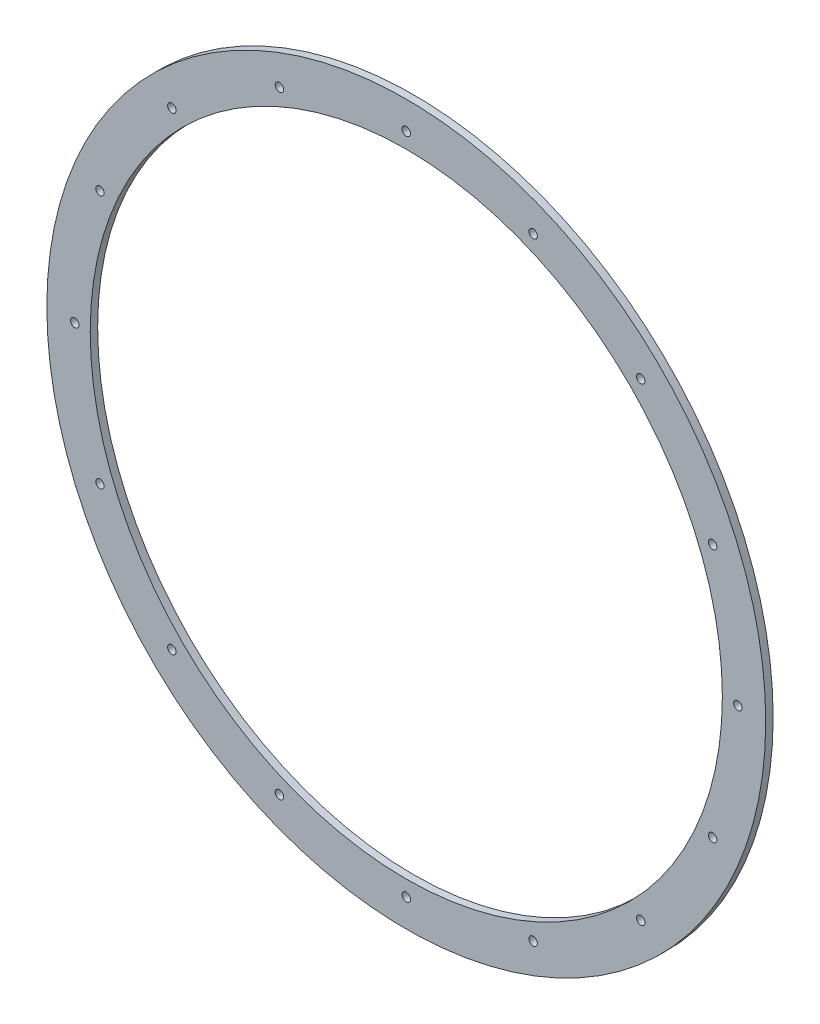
ISO-10303-21;
HEADER;
FILE_DESCRIPTION(('STEP AP214'),'2;1');
FILE_NAME('part.step','',(''),(''),'','','');
FILE_SCHEMA(('AUTOMOTIVE_DESIGN { 1 0 10303 214 1 1 1 1 }'));
ENDSEC;
DATA;
#1=APPLICATION_CONTEXT('core data for automotive mechanical design processes');
#2=APPLICATION_PROTOCOL_DEFINITION('international standard','automotive_design',2000,#1);
#3=PRODUCT_CONTEXT('',#1,'mechanical');
#4=PRODUCT('Part','Part','',(#3));
#5=PRODUCT_RELATED_PRODUCT_CATEGORY('part','',(#4));
#6=PRODUCT_DEFINITION_FORMATION('','',#4);
#7=PRODUCT_DEFINITION_CONTEXT('part definition',#1,'design');
#8=PRODUCT_DEFINITION('design','',#6,#7);
#9=PRODUCT_DEFINITION_SHAPE('','',#8);
#10=(LENGTH_UNIT() NAMED_UNIT(*) SI_UNIT(.MILLI.,.METRE.));
#11=(NAMED_UNIT(*) PLANE_ANGLE_UNIT() SI_UNIT($,.RADIAN.));
#12=(NAMED_UNIT(*) SI_UNIT($,.STERADIAN.) SOLID_ANGLE_UNIT());
#13=UNCERTAINTY_MEASURE_WITH_UNIT(LENGTH_MEASURE(1.E-05),#10,'distance_accuracy_value','');
#14=(GEOMETRIC_REPRESENTATION_CONTEXT(3) GLOBAL_UNCERTAINTY_ASSIGNED_CONTEXT((#13)) GLOBAL_UNIT_ASSIGNED_CONTEXT((#10,
#11,#12)) REPRESENTATION_CONTEXT('',''));
#15=CARTESIAN_POINT('',(0.,0.,0.));
#16=DIRECTION('',(0.,0.,1.));
#17=DIRECTION('',(1.,0.,0.));
#18=AXIS2_PLACEMENT_3D('',#15,#16,#17);
#19=CARTESIAN_POINT('',(0.,0.,3.));
#20=DIRECTION('',(0.,0.,1.));
#21=DIRECTION('',(1.,0.,0.));
#22=AXIS2_PLACEMENT_3D('',#19,#20,#21);
#23=PLANE('',#22);
#24=CARTESIAN_POINT('',(-102.36781815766,-247.13777494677,3.));
#25=DIRECTION('',(0.,0.,-1.));
#26=DIRECTION('',(-1.,0.,0.));
#27=AXIS2_PLACEMENT_3D('',#24,#25,#26);
#28=CIRCLE('',#27,3.4);
#29=CARTESIAN_POINT('',(-105.76781815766,-247.13777494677,3.));
#30=VERTEX_POINT('',#29);
#31=EDGE_CURVE('E89',#30,#30,#28,.T.);
#32=ORIENTED_EDGE('',*,*,#31,.T.);
#33=EDGE_LOOP('',(#32));
#34=FACE_BOUND('',#33,.T.);
#35=CARTESIAN_POINT('',(-189.1510639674,-189.151063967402,3.));
#36=DIRECTION('',(0.,0.,-1.));
#37=DIRECTION('',(-1.,0.,0.));
#38=AXIS2_PLACEMENT_3D('',#35,#36,#37);
#39=CIRCLE('',#38,3.39999999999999);
#40=CARTESIAN_POINT('',(-192.5510639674,-189.151063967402,3.));
#41=VERTEX_POINT('',#40);
#42=EDGE_CURVE('E83',#41,#41,#39,.T.);
#43=ORIENTED_EDGE('',*,*,#42,.T.);
#44=EDGE_LOOP('',(#43));
#45=FACE_BOUND('',#44,.T.);
#46=CARTESIAN_POINT('',(-247.137774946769,-102.367818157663,3.));
#47=DIRECTION('',(0.,0.,-1.));
#48=DIRECTION('',(-1.,0.,0.));
#49=AXIS2_PLACEMENT_3D('',#46,#47,#48);
#50=CIRCLE('',#49,3.39999999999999);
#51=CARTESIAN_POINT('',(-250.537774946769,-102.367818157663,3.));
#52=VERTEX_POINT('',#51);
#53=EDGE_CURVE('E77',#52,#52,#50,.T.);
#54=ORIENTED_EDGE('',*,*,#53,.T.);
#55=EDGE_LOOP('',(#54));
#56=FACE_BOUND('',#55,.T.);
#57=CARTESIAN_POINT('',(-267.5,-9.3397179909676E-13,3.));
#58=DIRECTION('',(0.,0.,-1.));
#59=DIRECTION('',(-1.,0.,0.));
#60=AXIS2_PLACEMENT_3D('',#57,#58,#59);
#61=CIRCLE('',#60,3.40000000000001);
#62=CARTESIAN_POINT('',(-270.9,-9.3397179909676E-13,3.));
#63=VERTEX_POINT('',#62);
#64=EDGE_CURVE('E71',#63,#63,#61,.T.);
#65=ORIENTED_EDGE('',*,*,#64,.T.);
#66=EDGE_LOOP('',(#65));
#67=FACE_BOUND('',#66,.T.);
#68=CARTESIAN_POINT('',(-247.137774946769,102.367818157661,3.));
#69=DIRECTION('',(0.,0.,-1.));
#70=DIRECTION('',(-1.,0.,0.));
#71=AXIS2_PLACEMENT_3D('',#68,#69,#70);
#72=CIRCLE('',#71,3.39999999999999);
#73=CARTESIAN_POINT('',(-250.537774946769,102.367818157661,3.));
#74=VERTEX_POINT('',#73);
#75=EDGE_CURVE('E65',#74,#74,#72,.T.);
#76=ORIENTED_EDGE('',*,*,#75,.T.);
#77=EDGE_LOOP('',(#76));
#78=FACE_BOUND('',#77,.T.);
#79=CARTESIAN_POINT('',(-189.151063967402,189.151063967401,3.));
#80=DIRECTION('',(0.,0.,-1.));
#81=DIRECTION('',(-1.,0.,0.));
#82=AXIS2_PLACEMENT_3D('',#79,#80,#81);
#83=CIRCLE('',#82,3.39999999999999);
#84=CARTESIAN_POINT('',(-192.551063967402,189.151063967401,3.));
#85=VERTEX_POINT('',#84);
#86=EDGE_CURVE('E59',#85,#85,#83,.T.);
#87=ORIENTED_EDGE('',*,*,#86,.T.);
#88=EDGE_LOOP('',(#87));
#89=FACE_BOUND('',#88,.T.);
#90=CARTESIAN_POINT('',(-102.367818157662,247.137774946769,3.));
#91=DIRECTION('',(0.,0.,-1.));
#92=DIRECTION('',(-1.,0.,0.));
#93=AXIS2_PLACEMENT_3D('',#90,#91,#92);
#94=CIRCLE('',#93,3.4);
#95=CARTESIAN_POINT('',(-105.767818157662,247.137774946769,3.));
#96=VERTEX_POINT('',#95);
#97=EDGE_CURVE('E53',#96,#96,#94,.T.);
#98=ORIENTED_EDGE('',*,*,#97,.T.);
#99=EDGE_LOOP('',(#98));
#100=FACE_BOUND('',#99,.T.);
#101=CARTESIAN_POINT('',(0.,267.5,3.));
#102=DIRECTION('',(0.,0.,-1.));
#103=DIRECTION('',(-1.,0.,0.));
#104=AXIS2_PLACEMENT_3D('',#101,#102,#103);
#105=CIRCLE('',#104,3.4);
#106=CARTESIAN_POINT('',(-3.4,267.5,3.));
#107=VERTEX_POINT('',#106);
#108=EDGE_CURVE('E45',#107,#107,#105,.T.);
#109=ORIENTED_EDGE('',*,*,#108,.T.);
#110=EDGE_LOOP('',(#109));
#111=FACE_BOUND('',#110,.T.);
#112=CARTESIAN_POINT('',(0.,0.,3.));
#113=DIRECTION('',(0.,0.,1.));
#114=DIRECTION('',(1.,0.,0.));
#115=AXIS2_PLACEMENT_3D('',#112,#113,#114);
#116=CIRCLE('',#115,290.);
#117=CARTESIAN_POINT('',(290.,0.,3.));
#118=VERTEX_POINT('',#117);
#119=EDGE_CURVE('E10',#118,#118,#116,.T.);
#120=ORIENTED_EDGE('',*,*,#119,.T.);
#121=EDGE_LOOP('',(#120));
#122=FACE_BOUND('',#121,.T.);
#123=CARTESIAN_POINT('',(0.,0.,3.));
#124=DIRECTION('',(0.,0.,1.));
#125=DIRECTION('',(1.,0.,0.));
#126=AXIS2_PLACEMENT_3D('',#123,#124,#125);
#127=CIRCLE('',#126,255.);
#128=CARTESIAN_POINT('',(255.,0.,3.));
#129=VERTEX_POINT('',#128);
#130=EDGE_CURVE('E40',#129,#129,#127,.T.);
#131=ORIENTED_EDGE('',*,*,#130,.F.);
#132=EDGE_LOOP('',(#131));
#133=FACE_BOUND('',#132,.T.);
#134=CARTESIAN_POINT('',(1.86794359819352E-12,-267.5,3.));
#135=DIRECTION('',(0.,0.,-1.));
#136=DIRECTION('',(-1.,0.,0.));
#137=AXIS2_PLACEMENT_3D('',#134,#135,#136);
#138=CIRCLE('',#137,3.4);
#139=CARTESIAN_POINT('',(-3.39999999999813,-267.5,3.));
#140=VERTEX_POINT('',#139);
#141=EDGE_CURVE('E95',#140,#140,#138,.T.);
#142=ORIENTED_EDGE('',*,*,#141,.T.);
#143=EDGE_LOOP('',(#142));
#144=FACE_BOUND('',#143,.T.);
#145=CARTESIAN_POINT('',(102.367818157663,-247.137774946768,3.));
#146=DIRECTION('',(0.,0.,-1.));
#147=DIRECTION('',(-1.,0.,0.));
#148=AXIS2_PLACEMENT_3D('',#145,#146,#147);
#149=CIRCLE('',#148,3.4);
#150=CARTESIAN_POINT('',(98.9678181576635,-247.137774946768,3.));
#151=VERTEX_POINT('',#150);
#152=EDGE_CURVE('E101',#151,#151,#149,.T.);
#153=ORIENTED_EDGE('',*,*,#152,.T.);
#154=EDGE_LOOP('',(#153));
#155=FACE_BOUND('',#154,.T.);
#156=CARTESIAN_POINT('',(189.151063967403,-189.1510639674,3.));
#157=DIRECTION('',(0.,0.,-1.));
#158=DIRECTION('',(-1.,0.,0.));
#159=AXIS2_PLACEMENT_3D('',#156,#157,#158);
#160=CIRCLE('',#159,3.39999999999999);
#161=CARTESIAN_POINT('',(185.751063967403,-189.1510639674,3.));
#162=VERTEX_POINT('',#161);
#163=EDGE_CURVE('E107',#162,#162,#160,.T.);
#164=ORIENTED_EDGE('',*,*,#163,.T.);
#165=EDGE_LOOP('',(#164));
#166=FACE_BOUND('',#165,.T.);
#167=CARTESIAN_POINT('',(247.13777494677,-102.367818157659,3.));
#168=DIRECTION('',(0.,0.,-1.));
#169=DIRECTION('',(-1.,0.,0.));
#170=AXIS2_PLACEMENT_3D('',#167,#168,#169);
#171=CIRCLE('',#170,3.40000000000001);
#172=CARTESIAN_POINT('',(243.73777494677,-102.367818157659,3.));
#173=VERTEX_POINT('',#172);
#174=EDGE_CURVE('E113',#173,#173,#171,.T.);
#175=ORIENTED_EDGE('',*,*,#174,.T.);
#176=EDGE_LOOP('',(#175));
#177=FACE_BOUND('',#176,.T.);
#178=CARTESIAN_POINT('',(267.5,2.80191539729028E-12,3.));
#179=DIRECTION('',(0.,0.,-1.));
#180=DIRECTION('',(-1.,0.,0.));
#181=AXIS2_PLACEMENT_3D('',#178,#179,#180);
#182=CIRCLE('',#181,3.40000000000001);
#183=CARTESIAN_POINT('',(264.1,2.80191539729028E-12,3.));
#184=VERTEX_POINT('',#183);
#185=EDGE_CURVE('E119',#184,#184,#182,.T.);
#186=ORIENTED_EDGE('',*,*,#185,.T.);
#187=EDGE_LOOP('',(#186));
#188=FACE_BOUND('',#187,.T.);
#189=CARTESIAN_POINT('',(247.137774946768,102.367818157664,3.));
#190=DIRECTION('',(0.,0.,-1.));
#191=DIRECTION('',(-1.,0.,0.));
#192=AXIS2_PLACEMENT_3D('',#189,#190,#191);
#193=CIRCLE('',#192,3.39999999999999);
#194=CARTESIAN_POINT('',(243.737774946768,102.367818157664,3.));
#195=VERTEX_POINT('',#194);
#196=EDGE_CURVE('E125',#195,#195,#193,.T.);
#197=ORIENTED_EDGE('',*,*,#196,.T.);
#198=EDGE_LOOP('',(#197));
#199=FACE_BOUND('',#198,.T.);
#200=CARTESIAN_POINT('',(189.151063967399,189.151063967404,3.));
#201=DIRECTION('',(0.,0.,-1.));
#202=DIRECTION('',(-1.,0.,0.));
#203=AXIS2_PLACEMENT_3D('',#200,#201,#202);
#204=CIRCLE('',#203,3.39999999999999);
#205=CARTESIAN_POINT('',(185.751063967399,189.151063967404,3.));
#206=VERTEX_POINT('',#205);
#207=EDGE_CURVE('E131',#206,#206,#204,.T.);
#208=ORIENTED_EDGE('',*,*,#207,.T.);
#209=EDGE_LOOP('',(#208));
#210=FACE_BOUND('',#209,.T.);
#211=CARTESIAN_POINT('',(102.367818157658,247.137774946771,3.));
#212=DIRECTION('',(0.,0.,-1.));
#213=DIRECTION('',(-1.,0.,0.));
#214=AXIS2_PLACEMENT_3D('',#211,#212,#213);
#215=CIRCLE('',#214,3.4);
#216=CARTESIAN_POINT('',(98.9678181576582,247.137774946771,3.));
#217=VERTEX_POINT('',#216);
#218=EDGE_CURVE('E137',#217,#217,#215,.T.);
#219=ORIENTED_EDGE('',*,*,#218,.T.);
#220=EDGE_LOOP('',(#219));
#221=FACE_BOUND('',#220,.T.);
#222=ADVANCED_FACE('F29',(#34,#45,#56,#67,#78,#89,#100,#111,#122,#133,#144,#155,#166,#177,#188,
#199,#210,#221),#23,.T.);
#223=CARTESIAN_POINT('',(0.,0.,-3.));
#224=DIRECTION('',(0.,0.,1.));
#225=DIRECTION('',(1.,0.,0.));
#226=AXIS2_PLACEMENT_3D('',#223,#224,#225);
#227=PLANE('',#226);
#228=CARTESIAN_POINT('',(102.367818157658,247.137774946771,-3.));
#229=DIRECTION('',(0.,0.,-1.));
#230=DIRECTION('',(-1.,0.,0.));
#231=AXIS2_PLACEMENT_3D('',#228,#229,#230);
#232=CIRCLE('',#231,3.39999999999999);
#233=CARTESIAN_POINT('',(98.9678181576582,247.137774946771,-3.));
#234=VERTEX_POINT('',#233);
#235=EDGE_CURVE('E140',#234,#234,#232,.T.);
#236=ORIENTED_EDGE('',*,*,#235,.F.);
#237=EDGE_LOOP('',(#236));
#238=FACE_BOUND('',#237,.T.);
#239=CARTESIAN_POINT('',(189.151063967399,189.151063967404,-3.));
#240=DIRECTION('',(0.,0.,-1.));
#241=DIRECTION('',(-1.,0.,0.));
#242=AXIS2_PLACEMENT_3D('',#239,#240,#241);
#243=CIRCLE('',#242,3.39999999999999);
#244=CARTESIAN_POINT('',(185.751063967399,189.151063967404,-3.));
#245=VERTEX_POINT('',#244);
#246=EDGE_CURVE('E134',#245,#245,#243,.T.);
#247=ORIENTED_EDGE('',*,*,#246,.F.);
#248=EDGE_LOOP('',(#247));
#249=FACE_BOUND('',#248,.T.);
#250=CARTESIAN_POINT('',(247.137774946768,102.367818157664,-3.));
#251=DIRECTION('',(0.,0.,-1.));
#252=DIRECTION('',(-1.,0.,0.));
#253=AXIS2_PLACEMENT_3D('',#250,#251,#252);
#254=CIRCLE('',#253,3.39999999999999);
#255=CARTESIAN_POINT('',(243.737774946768,102.367818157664,-3.));
#256=VERTEX_POINT('',#255);
#257=EDGE_CURVE('E128',#256,#256,#254,.T.);
#258=ORIENTED_EDGE('',*,*,#257,.F.);
#259=EDGE_LOOP('',(#258));
#260=FACE_BOUND('',#259,.T.);
#261=CARTESIAN_POINT('',(267.5,2.80191539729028E-12,-3.));
#262=DIRECTION('',(0.,0.,-1.));
#263=DIRECTION('',(-1.,0.,0.));
#264=AXIS2_PLACEMENT_3D('',#261,#262,#263);
#265=CIRCLE('',#264,3.40000000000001);
#266=CARTESIAN_POINT('',(264.1,2.80191539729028E-12,-3.));
#267=VERTEX_POINT('',#266);
#268=EDGE_CURVE('E122',#267,#267,#265,.T.);
#269=ORIENTED_EDGE('',*,*,#268,.F.);
#270=EDGE_LOOP('',(#269));
#271=FACE_BOUND('',#270,.T.);
#272=CARTESIAN_POINT('',(247.13777494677,-102.367818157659,-3.));
#273=DIRECTION('',(0.,0.,-1.));
#274=DIRECTION('',(-1.,0.,0.));
#275=AXIS2_PLACEMENT_3D('',#272,#273,#274);
#276=CIRCLE('',#275,3.40000000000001);
#277=CARTESIAN_POINT('',(243.73777494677,-102.367818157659,-3.));
#278=VERTEX_POINT('',#277);
#279=EDGE_CURVE('E116',#278,#278,#276,.T.);
#280=ORIENTED_EDGE('',*,*,#279,.F.);
#281=EDGE_LOOP('',(#280));
#282=FACE_BOUND('',#281,.T.);
#283=CARTESIAN_POINT('',(189.151063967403,-189.1510639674,-3.));
#284=DIRECTION('',(0.,0.,-1.));
#285=DIRECTION('',(-1.,0.,0.));
#286=AXIS2_PLACEMENT_3D('',#283,#284,#285);
#287=CIRCLE('',#286,3.39999999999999);
#288=CARTESIAN_POINT('',(185.751063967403,-189.1510639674,-3.));
#289=VERTEX_POINT('',#288);
#290=EDGE_CURVE('E110',#289,#289,#287,.T.);
#291=ORIENTED_EDGE('',*,*,#290,.F.);
#292=EDGE_LOOP('',(#291));
#293=FACE_BOUND('',#292,.T.);
#294=CARTESIAN_POINT('',(102.367818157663,-247.137774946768,-3.));
#295=DIRECTION('',(0.,0.,-1.));
#296=DIRECTION('',(-1.,0.,0.));
#297=AXIS2_PLACEMENT_3D('',#294,#295,#296);
#298=CIRCLE('',#297,3.39999999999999);
#299=CARTESIAN_POINT('',(98.9678181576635,-247.137774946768,-3.));
#300=VERTEX_POINT('',#299);
#301=EDGE_CURVE('E104',#300,#300,#298,.T.);
#302=ORIENTED_EDGE('',*,*,#301,.F.);
#303=EDGE_LOOP('',(#302));
#304=FACE_BOUND('',#303,.T.);
#305=CARTESIAN_POINT('',(0.,267.5,-3.));
#306=DIRECTION('',(0.,0.,-1.));
#307=DIRECTION('',(-1.,0.,0.));
#308=AXIS2_PLACEMENT_3D('',#305,#306,#307);
#309=CIRCLE('',#308,3.39999999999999);
#310=CARTESIAN_POINT('',(-3.39999999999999,267.5,-3.));
#311=VERTEX_POINT('',#310);
#312=EDGE_CURVE('E50',#311,#311,#309,.T.);
#313=ORIENTED_EDGE('',*,*,#312,.F.);
#314=EDGE_LOOP('',(#313));
#315=FACE_BOUND('',#314,.T.);
#316=CARTESIAN_POINT('',(0.,0.,-3.));
#317=DIRECTION('',(0.,0.,1.));
#318=DIRECTION('',(1.,0.,0.));
#319=AXIS2_PLACEMENT_3D('',#316,#317,#318);
#320=CIRCLE('',#319,290.);
#321=CARTESIAN_POINT('',(290.,0.,-3.));
#322=VERTEX_POINT('',#321);
#323=EDGE_CURVE('E33',#322,#322,#320,.T.);
#324=ORIENTED_EDGE('',*,*,#323,.F.);
#325=EDGE_LOOP('',(#324));
#326=FACE_BOUND('',#325,.T.);
#327=CARTESIAN_POINT('',(0.,0.,-3.));
#328=DIRECTION('',(0.,0.,1.));
#329=DIRECTION('',(1.,0.,0.));
#330=AXIS2_PLACEMENT_3D('',#327,#328,#329);
#331=CIRCLE('',#330,255.);
#332=CARTESIAN_POINT('',(255.,0.,-3.));
#333=VERTEX_POINT('',#332);
#334=EDGE_CURVE('E42',#333,#333,#331,.T.);
#335=ORIENTED_EDGE('',*,*,#334,.T.);
#336=EDGE_LOOP('',(#335));
#337=FACE_BOUND('',#336,.T.);
#338=CARTESIAN_POINT('',(-102.367818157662,247.137774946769,-3.));
#339=DIRECTION('',(0.,0.,-1.));
#340=DIRECTION('',(-1.,0.,0.));
#341=AXIS2_PLACEMENT_3D('',#338,#339,#340);
#342=CIRCLE('',#341,3.39999999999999);
#343=CARTESIAN_POINT('',(-105.767818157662,247.137774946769,-3.));
#344=VERTEX_POINT('',#343);
#345=EDGE_CURVE('E56',#344,#344,#342,.T.);
#346=ORIENTED_EDGE('',*,*,#345,.F.);
#347=EDGE_LOOP('',(#346));
#348=FACE_BOUND('',#347,.T.);
#349=CARTESIAN_POINT('',(-189.151063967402,189.151063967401,-3.));
#350=DIRECTION('',(0.,0.,-1.));
#351=DIRECTION('',(-1.,0.,0.));
#352=AXIS2_PLACEMENT_3D('',#349,#350,#351);
#353=CIRCLE('',#352,3.39999999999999);
#354=CARTESIAN_POINT('',(-192.551063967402,189.151063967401,-3.));
#355=VERTEX_POINT('',#354);
#356=EDGE_CURVE('E62',#355,#355,#353,.T.);
#357=ORIENTED_EDGE('',*,*,#356,.F.);
#358=EDGE_LOOP('',(#357));
#359=FACE_BOUND('',#358,.T.);
#360=CARTESIAN_POINT('',(-247.137774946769,102.367818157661,-3.));
#361=DIRECTION('',(0.,0.,-1.));
#362=DIRECTION('',(-1.,0.,0.));
#363=AXIS2_PLACEMENT_3D('',#360,#361,#362);
#364=CIRCLE('',#363,3.39999999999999);
#365=CARTESIAN_POINT('',(-250.537774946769,102.367818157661,-3.));
#366=VERTEX_POINT('',#365);
#367=EDGE_CURVE('E68',#366,#366,#364,.T.);
#368=ORIENTED_EDGE('',*,*,#367,.F.);
#369=EDGE_LOOP('',(#368));
#370=FACE_BOUND('',#369,.T.);
#371=CARTESIAN_POINT('',(-267.5,-9.3397179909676E-13,-3.));
#372=DIRECTION('',(0.,0.,-1.));
#373=DIRECTION('',(-1.,0.,0.));
#374=AXIS2_PLACEMENT_3D('',#371,#372,#373);
#375=CIRCLE('',#374,3.40000000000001);
#376=CARTESIAN_POINT('',(-270.9,-9.3397179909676E-13,-3.));
#377=VERTEX_POINT('',#376);
#378=EDGE_CURVE('E74',#377,#377,#375,.T.);
#379=ORIENTED_EDGE('',*,*,#378,.F.);
#380=EDGE_LOOP('',(#379));
#381=FACE_BOUND('',#380,.T.);
#382=CARTESIAN_POINT('',(-247.137774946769,-102.367818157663,-3.));
#383=DIRECTION('',(0.,0.,-1.));
#384=DIRECTION('',(-1.,0.,0.));
#385=AXIS2_PLACEMENT_3D('',#382,#383,#384);
#386=CIRCLE('',#385,3.39999999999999);
#387=CARTESIAN_POINT('',(-250.537774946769,-102.367818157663,-3.));
#388=VERTEX_POINT('',#387);
#389=EDGE_CURVE('E80',#388,#388,#386,.T.);
#390=ORIENTED_EDGE('',*,*,#389,.F.);
#391=EDGE_LOOP('',(#390));
#392=FACE_BOUND('',#391,.T.);
#393=CARTESIAN_POINT('',(-189.1510639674,-189.151063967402,-3.));
#394=DIRECTION('',(0.,0.,-1.));
#395=DIRECTION('',(-1.,0.,0.));
#396=AXIS2_PLACEMENT_3D('',#393,#394,#395);
#397=CIRCLE('',#396,3.39999999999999);
#398=CARTESIAN_POINT('',(-192.5510639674,-189.151063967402,-3.));
#399=VERTEX_POINT('',#398);
#400=EDGE_CURVE('E86',#399,#399,#397,.T.);
#401=ORIENTED_EDGE('',*,*,#400,.F.);
#402=EDGE_LOOP('',(#401));
#403=FACE_BOUND('',#402,.T.);
#404=CARTESIAN_POINT('',(-102.36781815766,-247.13777494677,-3.));
#405=DIRECTION('',(0.,0.,-1.));
#406=DIRECTION('',(-1.,0.,0.));
#407=AXIS2_PLACEMENT_3D('',#404,#405,#406);
#408=CIRCLE('',#407,3.39999999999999);
#409=CARTESIAN_POINT('',(-105.76781815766,-247.13777494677,-3.));
#410=VERTEX_POINT('',#409);
#411=EDGE_CURVE('E92',#410,#410,#408,.T.);
#412=ORIENTED_EDGE('',*,*,#411,.F.);
#413=EDGE_LOOP('',(#412));
#414=FACE_BOUND('',#413,.T.);
#415=CARTESIAN_POINT('',(1.86794359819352E-12,-267.5,-3.));
#416=DIRECTION('',(0.,0.,-1.));
#417=DIRECTION('',(-1.,0.,0.));
#418=AXIS2_PLACEMENT_3D('',#415,#416,#417);
#419=CIRCLE('',#418,3.39999999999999);
#420=CARTESIAN_POINT('',(-3.39999999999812,-267.5,-3.));
#421=VERTEX_POINT('',#420);
#422=EDGE_CURVE('E98',#421,#421,#419,.T.);
#423=ORIENTED_EDGE('',*,*,#422,.F.);
#424=EDGE_LOOP('',(#423));
#425=FACE_BOUND('',#424,.T.);
#426=ADVANCED_FACE('F146',(#238,#249,#260,#271,#282,#293,#304,#315,#326,#337,#348,#359,#370,
#381,#392,#403,#414,#425),#227,.F.);
#427=CARTESIAN_POINT('',(0.,0.,3.));
#428=DIRECTION('',(0.,0.,-1.));
#429=DIRECTION('',(-1.,0.,0.));
#430=AXIS2_PLACEMENT_3D('',#427,#428,#429);
#431=CYLINDRICAL_SURFACE('',#430,290.);
#432=ORIENTED_EDGE('',*,*,#119,.F.);
#433=EDGE_LOOP('',(#432));
#434=FACE_BOUND('',#433,.T.);
#435=ORIENTED_EDGE('',*,*,#323,.T.);
#436=EDGE_LOOP('',(#435));
#437=FACE_BOUND('',#436,.T.);
#438=ADVANCED_FACE('F31',(#434,#437),#431,.T.);
#439=CARTESIAN_POINT('',(0.,0.,3.));
#440=DIRECTION('',(0.,0.,-1.));
#441=DIRECTION('',(-1.,0.,0.));
#442=AXIS2_PLACEMENT_3D('',#439,#440,#441);
#443=CYLINDRICAL_SURFACE('',#442,255.);
#444=ORIENTED_EDGE('',*,*,#130,.T.);
#445=EDGE_LOOP('',(#444));
#446=FACE_BOUND('',#445,.T.);
#447=ORIENTED_EDGE('',*,*,#334,.F.);
#448=EDGE_LOOP('',(#447));
#449=FACE_BOUND('',#448,.T.);
#450=ADVANCED_FACE('F207',(#446,#449),#443,.F.);
#451=CARTESIAN_POINT('',(0.,267.5,-3.));
#452=DIRECTION('',(0.,0.,-1.));
#453=DIRECTION('',(-1.,0.,0.));
#454=AXIS2_PLACEMENT_3D('',#451,#452,#453);
#455=CYLINDRICAL_SURFACE('',#454,3.39999999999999);
#456=ORIENTED_EDGE('',*,*,#108,.F.);
#457=EDGE_LOOP('',(#456));
#458=FACE_BOUND('',#457,.T.);
#459=ORIENTED_EDGE('',*,*,#312,.T.);
#460=EDGE_LOOP('',(#459));
#461=FACE_BOUND('',#460,.T.);
#462=ADVANCED_FACE('F210',(#458,#461),#455,.F.);
#463=CARTESIAN_POINT('',(-102.367818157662,247.137774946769,-3.));
#464=DIRECTION('',(0.,0.,-1.));
#465=DIRECTION('',(-1.,0.,0.));
#466=AXIS2_PLACEMENT_3D('',#463,#464,#465);
#467=CYLINDRICAL_SURFACE('',#466,3.39999999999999);
#468=ORIENTED_EDGE('',*,*,#97,.F.);
#469=EDGE_LOOP('',(#468));
#470=FACE_BOUND('',#469,.T.);
#471=ORIENTED_EDGE('',*,*,#345,.T.);
#472=EDGE_LOOP('',(#471));
#473=FACE_BOUND('',#472,.T.);
#474=ADVANCED_FACE('F214',(#470,#473),#467,.F.);
#475=CARTESIAN_POINT('',(-189.151063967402,189.151063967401,-3.));
#476=DIRECTION('',(0.,0.,-1.));
#477=DIRECTION('',(-1.,0.,0.));
#478=AXIS2_PLACEMENT_3D('',#475,#476,#477);
#479=CYLINDRICAL_SURFACE('',#478,3.39999999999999);
#480=ORIENTED_EDGE('',*,*,#86,.F.);
#481=EDGE_LOOP('',(#480));
#482=FACE_BOUND('',#481,.T.);
#483=ORIENTED_EDGE('',*,*,#356,.T.);
#484=EDGE_LOOP('',(#483));
#485=FACE_BOUND('',#484,.T.);
#486=ADVANCED_FACE('F218',(#482,#485),#479,.F.);
#487=CARTESIAN_POINT('',(-247.137774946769,102.367818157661,-3.));
#488=DIRECTION('',(0.,0.,-1.));
#489=DIRECTION('',(-1.,0.,0.));
#490=AXIS2_PLACEMENT_3D('',#487,#488,#489);
#491=CYLINDRICAL_SURFACE('',#490,3.39999999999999);
#492=ORIENTED_EDGE('',*,*,#75,.F.);
#493=EDGE_LOOP('',(#492));
#494=FACE_BOUND('',#493,.T.);
#495=ORIENTED_EDGE('',*,*,#367,.T.);
#496=EDGE_LOOP('',(#495));
#497=FACE_BOUND('',#496,.T.);
#498=ADVANCED_FACE('F222',(#494,#497),#491,.F.);
#499=CARTESIAN_POINT('',(-267.5,-9.3397179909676E-13,-3.));
#500=DIRECTION('',(0.,0.,-1.));
#501=DIRECTION('',(-1.,0.,0.));
#502=AXIS2_PLACEMENT_3D('',#499,#500,#501);
#503=CYLINDRICAL_SURFACE('',#502,3.40000000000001);
#504=ORIENTED_EDGE('',*,*,#64,.F.);
#505=EDGE_LOOP('',(#504));
#506=FACE_BOUND('',#505,.T.);
#507=ORIENTED_EDGE('',*,*,#378,.T.);
#508=EDGE_LOOP('',(#507));
#509=FACE_BOUND('',#508,.T.);
#510=ADVANCED_FACE('F226',(#506,#509),#503,.F.);
#511=CARTESIAN_POINT('',(-247.137774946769,-102.367818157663,-3.));
#512=DIRECTION('',(0.,0.,-1.));
#513=DIRECTION('',(-1.,0.,0.));
#514=AXIS2_PLACEMENT_3D('',#511,#512,#513);
#515=CYLINDRICAL_SURFACE('',#514,3.39999999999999);
#516=ORIENTED_EDGE('',*,*,#53,.F.);
#517=EDGE_LOOP('',(#516));
#518=FACE_BOUND('',#517,.T.);
#519=ORIENTED_EDGE('',*,*,#389,.T.);
#520=EDGE_LOOP('',(#519));
#521=FACE_BOUND('',#520,.T.);
#522=ADVANCED_FACE('F230',(#518,#521),#515,.F.);
#523=CARTESIAN_POINT('',(-189.1510639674,-189.151063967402,-3.));
#524=DIRECTION('',(0.,0.,-1.));
#525=DIRECTION('',(-1.,0.,0.));
#526=AXIS2_PLACEMENT_3D('',#523,#524,#525);
#527=CYLINDRICAL_SURFACE('',#526,3.39999999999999);
#528=ORIENTED_EDGE('',*,*,#42,.F.);
#529=EDGE_LOOP('',(#528));
#530=FACE_BOUND('',#529,.T.);
#531=ORIENTED_EDGE('',*,*,#400,.T.);
#532=EDGE_LOOP('',(#531));
#533=FACE_BOUND('',#532,.T.);
#534=ADVANCED_FACE('F196',(#530,#533),#527,.F.);
#535=CARTESIAN_POINT('',(-102.36781815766,-247.13777494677,-3.));
#536=DIRECTION('',(0.,0.,-1.));
#537=DIRECTION('',(-1.,0.,0.));
#538=AXIS2_PLACEMENT_3D('',#535,#536,#537);
#539=CYLINDRICAL_SURFACE('',#538,3.39999999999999);
#540=ORIENTED_EDGE('',*,*,#31,.F.);
#541=EDGE_LOOP('',(#540));
#542=FACE_BOUND('',#541,.T.);
#543=ORIENTED_EDGE('',*,*,#411,.T.);
#544=EDGE_LOOP('',(#543));
#545=FACE_BOUND('',#544,.T.);
#546=ADVANCED_FACE('F186',(#542,#545),#539,.F.);
#547=CARTESIAN_POINT('',(1.86794359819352E-12,-267.5,-3.));
#548=DIRECTION('',(0.,0.,-1.));
#549=DIRECTION('',(-1.,0.,0.));
#550=AXIS2_PLACEMENT_3D('',#547,#548,#549);
#551=CYLINDRICAL_SURFACE('',#550,3.39999999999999);
#552=ORIENTED_EDGE('',*,*,#141,.F.);
#553=EDGE_LOOP('',(#552));
#554=FACE_BOUND('',#553,.T.);
#555=ORIENTED_EDGE('',*,*,#422,.T.);
#556=EDGE_LOOP('',(#555));
#557=FACE_BOUND('',#556,.T.);
#558=ADVANCED_FACE('F183',(#554,#557),#551,.F.);
#559=CARTESIAN_POINT('',(102.367818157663,-247.137774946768,-3.));
#560=DIRECTION('',(0.,0.,-1.));
#561=DIRECTION('',(-1.,0.,0.));
#562=AXIS2_PLACEMENT_3D('',#559,#560,#561);
#563=CYLINDRICAL_SURFACE('',#562,3.39999999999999);
#564=ORIENTED_EDGE('',*,*,#152,.F.);
#565=EDGE_LOOP('',(#564));
#566=FACE_BOUND('',#565,.T.);
#567=ORIENTED_EDGE('',*,*,#301,.T.);
#568=EDGE_LOOP('',(#567));
#569=FACE_BOUND('',#568,.T.);
#570=ADVANCED_FACE('F185',(#566,#569),#563,.F.);
#571=CARTESIAN_POINT('',(189.151063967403,-189.1510639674,-3.));
#572=DIRECTION('',(0.,0.,-1.));
#573=DIRECTION('',(-1.,0.,0.));
#574=AXIS2_PLACEMENT_3D('',#571,#572,#573);
#575=CYLINDRICAL_SURFACE('',#574,3.39999999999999);
#576=ORIENTED_EDGE('',*,*,#163,.F.);
#577=EDGE_LOOP('',(#576));
#578=FACE_BOUND('',#577,.T.);
#579=ORIENTED_EDGE('',*,*,#290,.T.);
#580=EDGE_LOOP('',(#579));
#581=FACE_BOUND('',#580,.T.);
#582=ADVANCED_FACE('F193',(#578,#581),#575,.F.);
#583=CARTESIAN_POINT('',(247.13777494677,-102.367818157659,-3.));
#584=DIRECTION('',(0.,0.,-1.));
#585=DIRECTION('',(-1.,0.,0.));
#586=AXIS2_PLACEMENT_3D('',#583,#584,#585);
#587=CYLINDRICAL_SURFACE('',#586,3.40000000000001);
#588=ORIENTED_EDGE('',*,*,#174,.F.);
#589=EDGE_LOOP('',(#588));
#590=FACE_BOUND('',#589,.T.);
#591=ORIENTED_EDGE('',*,*,#279,.T.);
#592=EDGE_LOOP('',(#591));
#593=FACE_BOUND('',#592,.T.);
#594=ADVANCED_FACE('F287',(#590,#593),#587,.F.);
#595=CARTESIAN_POINT('',(267.5,2.80191539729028E-12,-3.));
#596=DIRECTION('',(0.,0.,-1.));
#597=DIRECTION('',(-1.,0.,0.));
#598=AXIS2_PLACEMENT_3D('',#595,#596,#597);
#599=CYLINDRICAL_SURFACE('',#598,3.40000000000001);
#600=ORIENTED_EDGE('',*,*,#185,.F.);
#601=EDGE_LOOP('',(#600));
#602=FACE_BOUND('',#601,.T.);
#603=ORIENTED_EDGE('',*,*,#268,.T.);
#604=EDGE_LOOP('',(#603));
#605=FACE_BOUND('',#604,.T.);
#606=ADVANCED_FACE('F283',(#602,#605),#599,.F.);
#607=CARTESIAN_POINT('',(247.137774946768,102.367818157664,-3.));
#608=DIRECTION('',(0.,0.,-1.));
#609=DIRECTION('',(-1.,0.,0.));
#610=AXIS2_PLACEMENT_3D('',#607,#608,#609);
#611=CYLINDRICAL_SURFACE('',#610,3.39999999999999);
#612=ORIENTED_EDGE('',*,*,#196,.F.);
#613=EDGE_LOOP('',(#612));
#614=FACE_BOUND('',#613,.T.);
#615=ORIENTED_EDGE('',*,*,#257,.T.);
#616=EDGE_LOOP('',(#615));
#617=FACE_BOUND('',#616,.T.);
#618=ADVANCED_FACE('F277',(#614,#617),#611,.F.);
#619=CARTESIAN_POINT('',(189.151063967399,189.151063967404,-3.));
#620=DIRECTION('',(0.,0.,-1.));
#621=DIRECTION('',(-1.,0.,0.));
#622=AXIS2_PLACEMENT_3D('',#619,#620,#621);
#623=CYLINDRICAL_SURFACE('',#622,3.39999999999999);
#624=ORIENTED_EDGE('',*,*,#207,.F.);
#625=EDGE_LOOP('',(#624));
#626=FACE_BOUND('',#625,.T.);
#627=ORIENTED_EDGE('',*,*,#246,.T.);
#628=EDGE_LOOP('',(#627));
#629=FACE_BOUND('',#628,.T.);
#630=ADVANCED_FACE('F272',(#626,#629),#623,.F.);
#631=CARTESIAN_POINT('',(102.367818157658,247.137774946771,-3.));
#632=DIRECTION('',(0.,0.,-1.));
#633=DIRECTION('',(-1.,0.,0.));
#634=AXIS2_PLACEMENT_3D('',#631,#632,#633);
#635=CYLINDRICAL_SURFACE('',#634,3.39999999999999);
#636=ORIENTED_EDGE('',*,*,#218,.F.);
#637=EDGE_LOOP('',(#636));
#638=FACE_BOUND('',#637,.T.);
#639=ORIENTED_EDGE('',*,*,#235,.T.);
#640=EDGE_LOOP('',(#639));
#641=FACE_BOUND('',#640,.T.);
#642=ADVANCED_FACE('F144',(#638,#641),#635,.F.);
#643=CLOSED_SHELL('',(#222,#426,#438,#450,#462,#474,#486,#498,#510,#522,#534,#546,#558,#570,
#582,#594,#606,#618,#630,#642));
#644=MANIFOLD_SOLID_BREP('B2',#643);
#645=ADVANCED_BREP_SHAPE_REPRESENTATION('',(#18,#644),#14);
#646=SHAPE_DEFINITION_REPRESENTATION(#9,#645);
ENDSEC;
END-ISO-10303-21;
